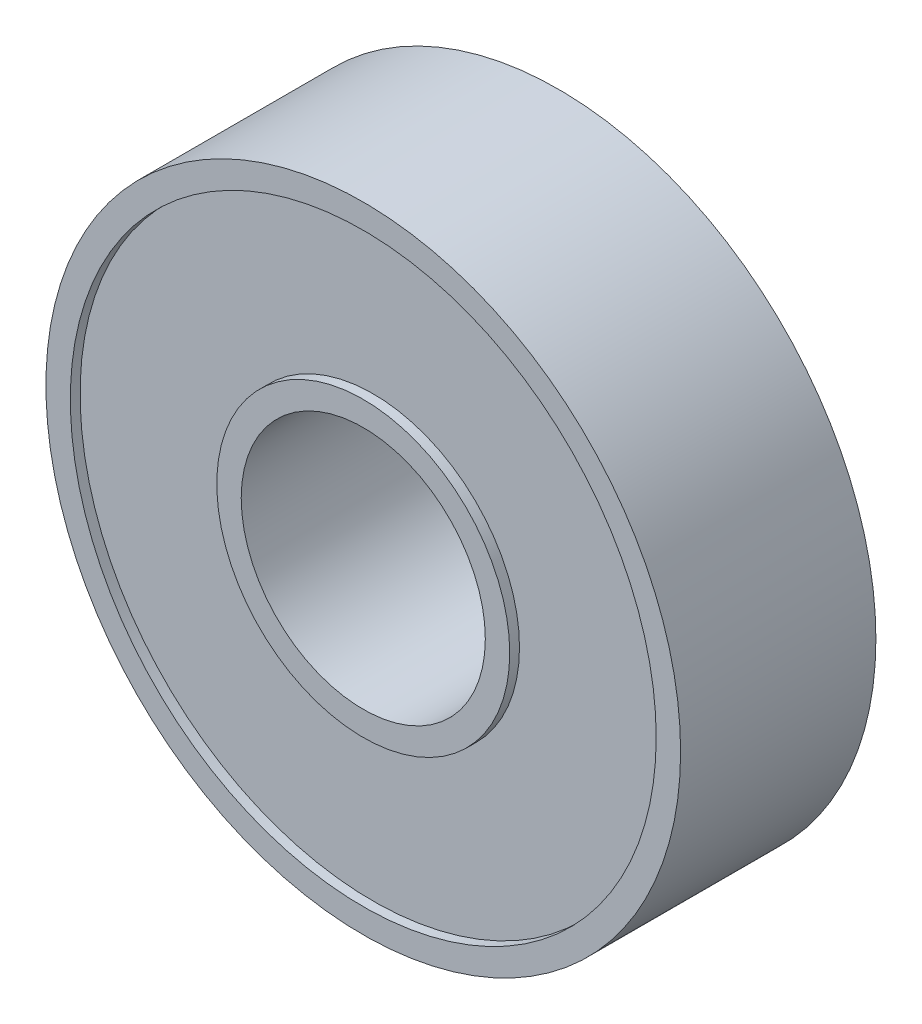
from build123d import *

# Parameters (mm, degrees)
SKETCH_1_R          = 6.5
SKETCH_1_R_2        = 2.5
EXTRUDE_1_DEPTH     = 4
SKETCH_2_R          = 6
SKETCH_2_R_2        = 3
CUT_EXTRUDE_1_DEPTH = 0.2
CUT_EXTRUDE_START   = -0.2
SKETCH_3_R          = 6
SKETCH_3_R_2        = 3
CUT_EXTRUDE_2_DEPTH = 0.2


with BuildPart() as part:
    # Sketch 1 → Extrude 1 (new body)
    with BuildSketch(Plane.XY):
        Circle(SKETCH_1_R)
        Circle(SKETCH_1_R_2, mode=Mode.SUBTRACT)
    extrude(amount=EXTRUDE_1_DEPTH)

    # Sketch 2 → Cut-Extrude 1 (cut)
    with BuildSketch(Plane.XY.offset(4)):
        Circle(SKETCH_2_R)
        Circle(SKETCH_2_R_2, mode=Mode.SUBTRACT)
    extrude(amount=-CUT_EXTRUDE_1_DEPTH, mode=Mode.SUBTRACT)

    # Sketch 3 → Cut-Extrude 2 (cut)
    with BuildSketch(Plane(origin=(0, 0, 0), x_dir=(-1, 0, 0), z_dir=(0, 0, -1)).offset(CUT_EXTRUDE_START)):
        with Locations(Location((0, 0, 0), (0, 0, 180))):
            Circle(SKETCH_3_R)
        with Locations(Location((0, 0, 0), (0, 0, 180))):
            Circle(SKETCH_3_R_2, mode=Mode.SUBTRACT)
    extrude(amount=CUT_EXTRUDE_2_DEPTH, mode=Mode.SUBTRACT)


solid = part.part
